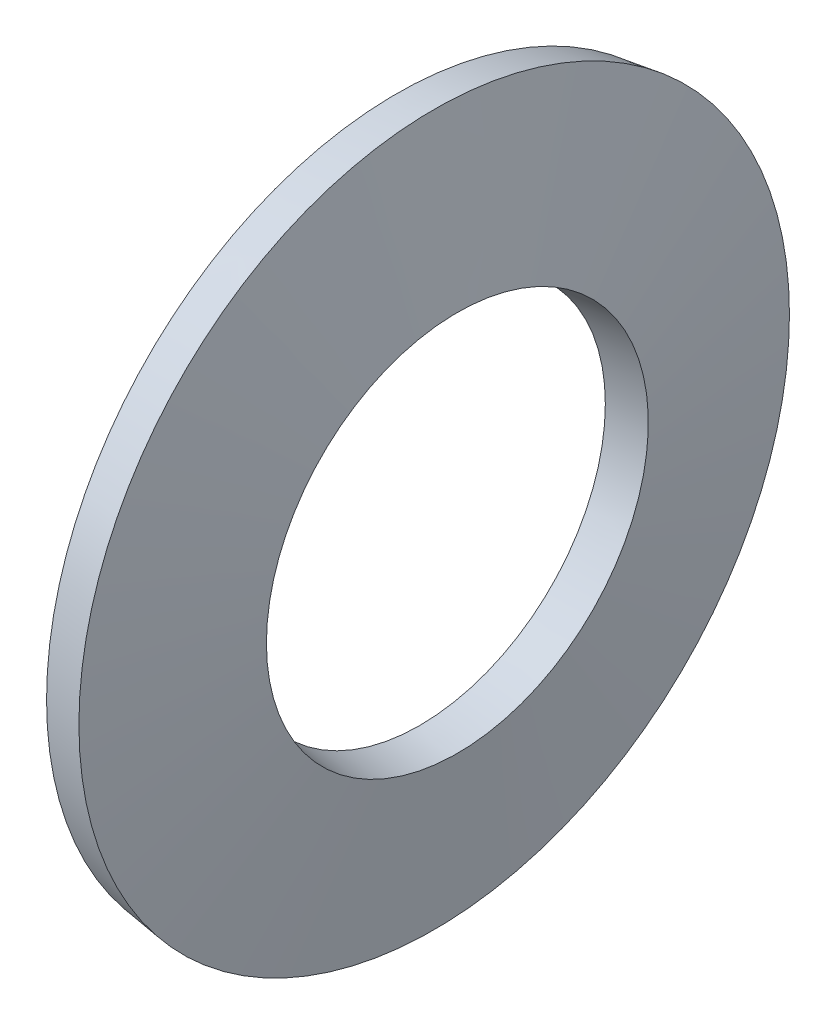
from build123d import *


with BuildPart() as part:
    # Esquisse1 → Base-R_volution (revolve)
    with BuildSketch(Plane.XY, mode=Mode.PRIVATE) as base_r_volution_sk:
        Polygon((0, 11.5), (0.762270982, 6.1), (2, 6.274719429), (1.237729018, 11.674719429), align=None)
    revolve(base_r_volution_sk.sketch.rotate(Axis((0, 0, 0), (1, 0, 0)), 90), axis=Axis((0, 0, 0), (1, 0, 0)))


solid = part.part
